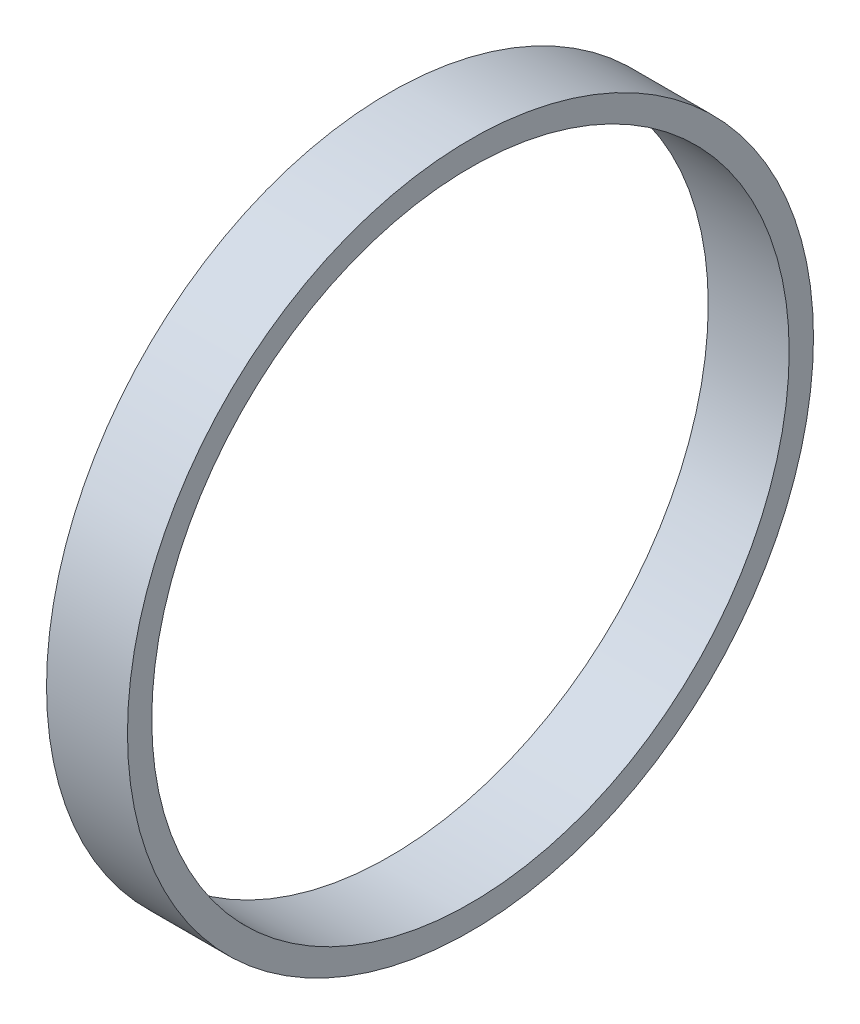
ISO-10303-21;
HEADER;
FILE_DESCRIPTION(('STEP AP214'),'2;1');
FILE_NAME('part.step','',(''),(''),'','','');
FILE_SCHEMA(('AUTOMOTIVE_DESIGN { 1 0 10303 214 1 1 1 1 }'));
ENDSEC;
DATA;
#1=APPLICATION_CONTEXT('core data for automotive mechanical design processes');
#2=APPLICATION_PROTOCOL_DEFINITION('international standard','automotive_design',2000,#1);
#3=PRODUCT_CONTEXT('',#1,'mechanical');
#4=PRODUCT('Part','Part','',(#3));
#5=PRODUCT_RELATED_PRODUCT_CATEGORY('part','',(#4));
#6=PRODUCT_DEFINITION_FORMATION('','',#4);
#7=PRODUCT_DEFINITION_CONTEXT('part definition',#1,'design');
#8=PRODUCT_DEFINITION('design','',#6,#7);
#9=PRODUCT_DEFINITION_SHAPE('','',#8);
#10=(LENGTH_UNIT() NAMED_UNIT(*) SI_UNIT(.MILLI.,.METRE.));
#11=(NAMED_UNIT(*) PLANE_ANGLE_UNIT() SI_UNIT($,.RADIAN.));
#12=(NAMED_UNIT(*) SI_UNIT($,.STERADIAN.) SOLID_ANGLE_UNIT());
#13=UNCERTAINTY_MEASURE_WITH_UNIT(LENGTH_MEASURE(1.E-05),#10,'distance_accuracy_value','');
#14=(GEOMETRIC_REPRESENTATION_CONTEXT(3) GLOBAL_UNCERTAINTY_ASSIGNED_CONTEXT((#13)) GLOBAL_UNIT_ASSIGNED_CONTEXT((#10,
#11,#12)) REPRESENTATION_CONTEXT('',''));
#15=CARTESIAN_POINT('',(0.,0.,0.));
#16=DIRECTION('',(0.,0.,1.));
#17=DIRECTION('',(1.,0.,0.));
#18=AXIS2_PLACEMENT_3D('',#15,#16,#17);
#19=CARTESIAN_POINT('',(0.,31.5,0.));
#20=DIRECTION('',(1.,0.,0.));
#21=DIRECTION('',(0.,0.,-1.));
#22=AXIS2_PLACEMENT_3D('',#19,#20,#21);
#23=PLANE('',#22);
#24=CARTESIAN_POINT('',(0.,0.,0.));
#25=DIRECTION('',(-1.,0.,0.));
#26=DIRECTION('',(0.,0.,1.));
#27=AXIS2_PLACEMENT_3D('',#24,#25,#26);
#28=CIRCLE('',#27,31.5);
#29=CARTESIAN_POINT('',(0.,0.,31.5));
#30=VERTEX_POINT('',#29);
#31=EDGE_CURVE('E43',#30,#30,#28,.T.);
#32=ORIENTED_EDGE('',*,*,#31,.F.);
#33=EDGE_LOOP('',(#32));
#34=FACE_BOUND('',#33,.T.);
#35=CARTESIAN_POINT('',(0.,0.,0.));
#36=DIRECTION('',(-1.,0.,0.));
#37=DIRECTION('',(0.,0.,1.));
#38=AXIS2_PLACEMENT_3D('',#35,#36,#37);
#39=CIRCLE('',#38,33.9);
#40=CARTESIAN_POINT('',(0.,0.,33.9));
#41=VERTEX_POINT('',#40);
#42=EDGE_CURVE('E10',#41,#41,#39,.T.);
#43=ORIENTED_EDGE('',*,*,#42,.T.);
#44=EDGE_LOOP('',(#43));
#45=FACE_BOUND('',#44,.T.);
#46=ADVANCED_FACE('F29',(#34,#45),#23,.F.);
#47=CARTESIAN_POINT('',(0.,0.,0.));
#48=DIRECTION('',(-1.,0.,0.));
#49=DIRECTION('',(0.,0.,1.));
#50=AXIS2_PLACEMENT_3D('',#47,#48,#49);
#51=CYLINDRICAL_SURFACE('',#50,33.9);
#52=ORIENTED_EDGE('',*,*,#42,.F.);
#53=EDGE_LOOP('',(#52));
#54=FACE_BOUND('',#53,.T.);
#55=CARTESIAN_POINT('',(8.,0.,0.));
#56=DIRECTION('',(-1.,0.,0.));
#57=DIRECTION('',(0.,0.,1.));
#58=AXIS2_PLACEMENT_3D('',#55,#56,#57);
#59=CIRCLE('',#58,33.9);
#60=CARTESIAN_POINT('',(8.,0.,33.9));
#61=VERTEX_POINT('',#60);
#62=EDGE_CURVE('E35',#61,#61,#59,.T.);
#63=ORIENTED_EDGE('',*,*,#62,.T.);
#64=EDGE_LOOP('',(#63));
#65=FACE_BOUND('',#64,.T.);
#66=ADVANCED_FACE('F52',(#54,#65),#51,.T.);
#67=CARTESIAN_POINT('',(8.,31.5,0.));
#68=DIRECTION('',(-1.,0.,0.));
#69=DIRECTION('',(0.,0.,1.));
#70=AXIS2_PLACEMENT_3D('',#67,#68,#69);
#71=PLANE('',#70);
#72=ORIENTED_EDGE('',*,*,#62,.F.);
#73=EDGE_LOOP('',(#72));
#74=FACE_BOUND('',#73,.T.);
#75=CARTESIAN_POINT('',(8.,0.,0.));
#76=DIRECTION('',(-1.,0.,0.));
#77=DIRECTION('',(0.,0.,1.));
#78=AXIS2_PLACEMENT_3D('',#75,#76,#77);
#79=CIRCLE('',#78,31.5);
#80=CARTESIAN_POINT('',(8.,0.,31.5));
#81=VERTEX_POINT('',#80);
#82=EDGE_CURVE('E39',#81,#81,#79,.T.);
#83=ORIENTED_EDGE('',*,*,#82,.T.);
#84=EDGE_LOOP('',(#83));
#85=FACE_BOUND('',#84,.T.);
#86=ADVANCED_FACE('F56',(#74,#85),#71,.F.);
#87=CARTESIAN_POINT('',(0.,0.,0.));
#88=DIRECTION('',(-1.,0.,0.));
#89=DIRECTION('',(0.,0.,1.));
#90=AXIS2_PLACEMENT_3D('',#87,#88,#89);
#91=CYLINDRICAL_SURFACE('',#90,31.5);
#92=ORIENTED_EDGE('',*,*,#82,.F.);
#93=EDGE_LOOP('',(#92));
#94=FACE_BOUND('',#93,.T.);
#95=ORIENTED_EDGE('',*,*,#31,.T.);
#96=EDGE_LOOP('',(#95));
#97=FACE_BOUND('',#96,.T.);
#98=ADVANCED_FACE('F49',(#94,#97),#91,.F.);
#99=CLOSED_SHELL('',(#46,#66,#86,#98));
#100=MANIFOLD_SOLID_BREP('B2',#99);
#101=ADVANCED_BREP_SHAPE_REPRESENTATION('',(#18,#100),#14);
#102=SHAPE_DEFINITION_REPRESENTATION(#9,#101);
ENDSEC;
END-ISO-10303-21;
